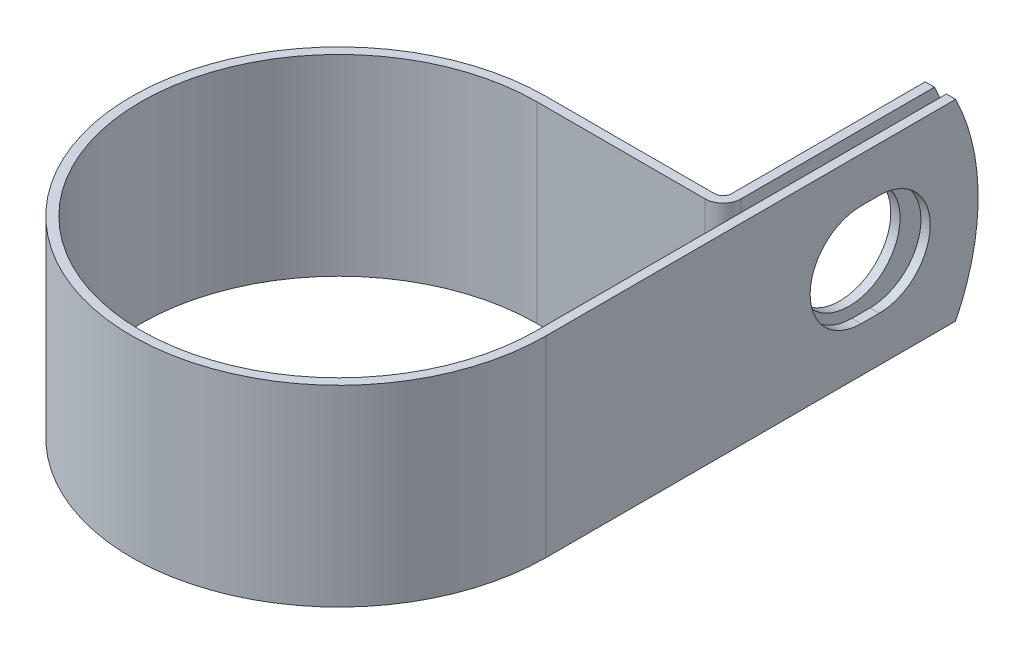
ISO-10303-21;
HEADER;
FILE_DESCRIPTION(('STEP AP214'),'2;1');
FILE_NAME('part.step','',(''),(''),'','','');
FILE_SCHEMA(('AUTOMOTIVE_DESIGN { 1 0 10303 214 1 1 1 1 }'));
ENDSEC;
DATA;
#1=APPLICATION_CONTEXT('core data for automotive mechanical design processes');
#2=APPLICATION_PROTOCOL_DEFINITION('international standard','automotive_design',2000,#1);
#3=PRODUCT_CONTEXT('',#1,'mechanical');
#4=PRODUCT('Part','Part','',(#3));
#5=PRODUCT_RELATED_PRODUCT_CATEGORY('part','',(#4));
#6=PRODUCT_DEFINITION_FORMATION('','',#4);
#7=PRODUCT_DEFINITION_CONTEXT('part definition',#1,'design');
#8=PRODUCT_DEFINITION('design','',#6,#7);
#9=PRODUCT_DEFINITION_SHAPE('','',#8);
#10=(LENGTH_UNIT() NAMED_UNIT(*) SI_UNIT(.MILLI.,.METRE.));
#11=(NAMED_UNIT(*) PLANE_ANGLE_UNIT() SI_UNIT($,.RADIAN.));
#12=(NAMED_UNIT(*) SI_UNIT($,.STERADIAN.) SOLID_ANGLE_UNIT());
#13=UNCERTAINTY_MEASURE_WITH_UNIT(LENGTH_MEASURE(1.E-05),#10,'distance_accuracy_value','');
#14=(GEOMETRIC_REPRESENTATION_CONTEXT(3) GLOBAL_UNCERTAINTY_ASSIGNED_CONTEXT((#13)) GLOBAL_UNIT_ASSIGNED_CONTEXT((#10,
#11,#12)) REPRESENTATION_CONTEXT('',''));
#15=CARTESIAN_POINT('',(0.,0.,0.));
#16=DIRECTION('',(0.,0.,1.));
#17=DIRECTION('',(1.,0.,0.));
#18=AXIS2_PLACEMENT_3D('',#15,#16,#17);
#19=CARTESIAN_POINT('',(26.1874,12.7,0.));
#20=DIRECTION('',(-1.,0.,0.));
#21=DIRECTION('',(0.,0.,1.));
#22=AXIS2_PLACEMENT_3D('',#19,#20,#21);
#23=PLANE('',#22);
#24=DIRECTION('',(0.,0.,-1.));
#25=VECTOR('',#24,1.);
#26=CARTESIAN_POINT('',(26.1874,-6.7437,-41.6559999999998));
#27=LINE('',#26,#25);
#28=CARTESIAN_POINT('',(26.1874,-6.7437,-41.6559999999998));
#29=VERTEX_POINT('',#28);
#30=CARTESIAN_POINT('',(26.1874,-6.7437,-44.0436000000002));
#31=VERTEX_POINT('',#30);
#32=EDGE_CURVE('E236',#29,#31,#27,.T.);
#33=ORIENTED_EDGE('',*,*,#32,.T.);
#34=CARTESIAN_POINT('',(26.1874,0.,-44.0435999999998));
#35=DIRECTION('',(-1.,0.,0.));
#36=DIRECTION('',(0.,0.,1.));
#37=AXIS2_PLACEMENT_3D('',#34,#35,#36);
#38=CIRCLE('',#37,6.7437);
#39=CARTESIAN_POINT('',(26.1874,6.7437,-44.0436000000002));
#40=VERTEX_POINT('',#39);
#41=EDGE_CURVE('E257',#31,#40,#38,.F.);
#42=ORIENTED_EDGE('',*,*,#41,.T.);
#43=DIRECTION('',(0.,0.,1.));
#44=VECTOR('',#43,1.);
#45=CARTESIAN_POINT('',(26.1874,6.7437,-41.6559999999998));
#46=LINE('',#45,#44);
#47=CARTESIAN_POINT('',(26.1874,6.7437,-41.6559999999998));
#48=VERTEX_POINT('',#47);
#49=EDGE_CURVE('E253',#40,#48,#46,.T.);
#50=ORIENTED_EDGE('',*,*,#49,.T.);
#51=CARTESIAN_POINT('',(26.1874,0.,-41.6559999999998));
#52=DIRECTION('',(-1.,0.,0.));
#53=DIRECTION('',(0.,0.,1.));
#54=AXIS2_PLACEMENT_3D('',#51,#52,#53);
#55=CIRCLE('',#54,6.7437);
#56=EDGE_CURVE('E248',#48,#29,#55,.F.);
#57=ORIENTED_EDGE('',*,*,#56,.T.);
#58=EDGE_LOOP('',(#33,#42,#50,#57));
#59=FACE_BOUND('',#58,.T.);
#60=CARTESIAN_POINT('',(26.1874,0.,-28.5496));
#61=DIRECTION('',(-1.,0.,0.));
#62=DIRECTION('',(0.,0.,1.));
#63=AXIS2_PLACEMENT_3D('',#60,#61,#62);
#64=CIRCLE('',#63,28.575);
#65=CARTESIAN_POINT('',(26.1874,12.7,-54.1472683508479));
#66=VERTEX_POINT('',#65);
#67=CARTESIAN_POINT('',(26.1874,-12.7,-54.1472683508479));
#68=VERTEX_POINT('',#67);
#69=EDGE_CURVE('E75',#66,#68,#64,.T.);
#70=ORIENTED_EDGE('',*,*,#69,.T.);
#71=DIRECTION('',(0.,0.,-1.));
#72=VECTOR('',#71,1.);
#73=CARTESIAN_POINT('',(26.1874,-12.7,0.));
#74=LINE('',#73,#72);
#75=CARTESIAN_POINT('',(26.1874,-12.7,0.));
#76=VERTEX_POINT('',#75);
#77=EDGE_CURVE('E271',#76,#68,#74,.T.);
#78=ORIENTED_EDGE('',*,*,#77,.F.);
#79=DIRECTION('',(0.,-1.,0.));
#80=VECTOR('',#79,1.);
#81=CARTESIAN_POINT('',(26.1874,12.7,0.));
#82=LINE('',#81,#80);
#83=CARTESIAN_POINT('',(26.1874,12.7,0.));
#84=VERTEX_POINT('',#83);
#85=EDGE_CURVE('E218',#84,#76,#82,.T.);
#86=ORIENTED_EDGE('',*,*,#85,.F.);
#87=DIRECTION('',(0.,0.,-1.));
#88=VECTOR('',#87,1.);
#89=CARTESIAN_POINT('',(26.1874,12.7,-26.1874));
#90=LINE('',#89,#88);
#91=EDGE_CURVE('E273',#84,#66,#90,.T.);
#92=ORIENTED_EDGE('',*,*,#91,.T.);
#93=EDGE_LOOP('',(#70,#78,#86,#92));
#94=FACE_BOUND('',#93,.T.);
#95=ADVANCED_FACE('F54',(#59,#94),#23,.T.);
#96=CARTESIAN_POINT('',(24.6126,12.7,-57.1246));
#97=DIRECTION('',(1.,0.,0.));
#98=DIRECTION('',(0.,0.,-1.));
#99=AXIS2_PLACEMENT_3D('',#96,#97,#98);
#100=PLANE('',#99);
#101=CARTESIAN_POINT('',(24.6126,0.,-42.8498));
#102=DIRECTION('',(1.,0.,0.));
#103=DIRECTION('',(0.,0.,-1.));
#104=AXIS2_PLACEMENT_3D('',#101,#102,#103);
#105=CIRCLE('',#104,6.7437);
#106=CARTESIAN_POINT('',(24.6126,0.,-49.5935));
#107=VERTEX_POINT('',#106);
#108=EDGE_CURVE('E268',#107,#107,#105,.F.);
#109=ORIENTED_EDGE('',*,*,#108,.T.);
#110=EDGE_LOOP('',(#109));
#111=FACE_BOUND('',#110,.T.);
#112=DIRECTION('',(0.,0.,1.));
#113=VECTOR('',#112,1.);
#114=CARTESIAN_POINT('',(24.6126,-12.7,-57.1246));
#115=LINE('',#114,#113);
#116=CARTESIAN_POINT('',(24.6126,-12.7,-54.1472683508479));
#117=VERTEX_POINT('',#116);
#118=CARTESIAN_POINT('',(24.6126,-12.7,-28.56484));
#119=VERTEX_POINT('',#118);
#120=EDGE_CURVE('E184',#117,#119,#115,.T.);
#121=ORIENTED_EDGE('',*,*,#120,.F.);
#122=CARTESIAN_POINT('',(24.6126,0.,-28.5496));
#123=DIRECTION('',(1.,0.,0.));
#124=DIRECTION('',(0.,0.,-1.));
#125=AXIS2_PLACEMENT_3D('',#122,#123,#124);
#126=CIRCLE('',#125,28.575);
#127=CARTESIAN_POINT('',(24.6126,12.7,-54.1472683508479));
#128=VERTEX_POINT('',#127);
#129=EDGE_CURVE('E176',#117,#128,#126,.T.);
#130=ORIENTED_EDGE('',*,*,#129,.T.);
#131=DIRECTION('',(0.,0.,1.));
#132=VECTOR('',#131,1.);
#133=CARTESIAN_POINT('',(24.6126,12.7,-57.1246));
#134=LINE('',#133,#132);
#135=CARTESIAN_POINT('',(24.6126,12.7,-28.56484));
#136=VERTEX_POINT('',#135);
#137=EDGE_CURVE('E224',#128,#136,#134,.T.);
#138=ORIENTED_EDGE('',*,*,#137,.T.);
#139=DIRECTION('',(0.,-1.,0.));
#140=VECTOR('',#139,1.);
#141=CARTESIAN_POINT('',(24.6126,12.7,-28.56484));
#142=LINE('',#141,#140);
#143=EDGE_CURVE('E211',#136,#119,#142,.T.);
#144=ORIENTED_EDGE('',*,*,#143,.T.);
#145=EDGE_LOOP('',(#121,#130,#138,#144));
#146=FACE_BOUND('',#145,.T.);
#147=ADVANCED_FACE('F226',(#111,#146),#100,.T.);
#148=CARTESIAN_POINT('',(23.3934,12.7,-57.1246));
#149=DIRECTION('',(1.,0.,0.));
#150=DIRECTION('',(0.,0.,-1.));
#151=AXIS2_PLACEMENT_3D('',#148,#149,#150);
#152=PLANE('',#151);
#153=CARTESIAN_POINT('',(23.3934,0.,-42.8498));
#154=DIRECTION('',(-1.,0.,0.));
#155=DIRECTION('',(0.,0.,1.));
#156=AXIS2_PLACEMENT_3D('',#153,#154,#155);
#157=CIRCLE('',#156,6.7437);
#158=CARTESIAN_POINT('',(23.3934,0.,-36.1061));
#159=VERTEX_POINT('',#158);
#160=EDGE_CURVE('E265',#159,#159,#157,.T.);
#161=ORIENTED_EDGE('',*,*,#160,.F.);
#162=EDGE_LOOP('',(#161));
#163=FACE_BOUND('',#162,.T.);
#164=CARTESIAN_POINT('',(23.3934,0.,-28.5496));
#165=DIRECTION('',(-1.,0.,0.));
#166=DIRECTION('',(0.,0.,1.));
#167=AXIS2_PLACEMENT_3D('',#164,#165,#166);
#168=CIRCLE('',#167,28.575);
#169=CARTESIAN_POINT('',(23.3934,12.7,-54.1472683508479));
#170=VERTEX_POINT('',#169);
#171=CARTESIAN_POINT('',(23.3934,-12.7,-54.1472683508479));
#172=VERTEX_POINT('',#171);
#173=EDGE_CURVE('E67',#170,#172,#168,.T.);
#174=ORIENTED_EDGE('',*,*,#173,.T.);
#175=DIRECTION('',(0.,0.,1.));
#176=VECTOR('',#175,1.);
#177=CARTESIAN_POINT('',(23.3934,-12.7,-57.1246));
#178=LINE('',#177,#176);
#179=CARTESIAN_POINT('',(23.3934,-12.7,-28.56484));
#180=VERTEX_POINT('',#179);
#181=EDGE_CURVE('E167',#172,#180,#178,.T.);
#182=ORIENTED_EDGE('',*,*,#181,.T.);
#183=DIRECTION('',(0.,-1.,0.));
#184=VECTOR('',#183,1.);
#185=CARTESIAN_POINT('',(23.3934,12.7,-28.56484));
#186=LINE('',#185,#184);
#187=CARTESIAN_POINT('',(23.3934,12.7,-28.56484));
#188=VERTEX_POINT('',#187);
#189=EDGE_CURVE('E209',#188,#180,#186,.T.);
#190=ORIENTED_EDGE('',*,*,#189,.F.);
#191=DIRECTION('',(0.,0.,1.));
#192=VECTOR('',#191,1.);
#193=CARTESIAN_POINT('',(23.3934,12.7,-57.1246));
#194=LINE('',#193,#192);
#195=EDGE_CURVE('E169',#170,#188,#194,.T.);
#196=ORIENTED_EDGE('',*,*,#195,.F.);
#197=EDGE_LOOP('',(#174,#182,#190,#196));
#198=FACE_BOUND('',#197,.T.);
#199=ADVANCED_FACE('F164',(#163,#198),#152,.F.);
#200=CARTESIAN_POINT('',(27.4066,12.7,0.));
#201=DIRECTION('',(-1.,0.,0.));
#202=DIRECTION('',(0.,0.,1.));
#203=AXIS2_PLACEMENT_3D('',#200,#201,#202);
#204=PLANE('',#203);
#205=CARTESIAN_POINT('',(27.4066,0.,-44.0435999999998));
#206=DIRECTION('',(1.,0.,0.));
#207=DIRECTION('',(0.,0.,-1.));
#208=AXIS2_PLACEMENT_3D('',#205,#206,#207);
#209=CIRCLE('',#208,6.7437);
#210=CARTESIAN_POINT('',(27.4066,-6.7437,-44.0436000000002));
#211=VERTEX_POINT('',#210);
#212=CARTESIAN_POINT('',(27.4066,6.7437,-44.0436000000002));
#213=VERTEX_POINT('',#212);
#214=EDGE_CURVE('E237',#211,#213,#209,.T.);
#215=ORIENTED_EDGE('',*,*,#214,.F.);
#216=DIRECTION('',(0.,0.,-1.));
#217=VECTOR('',#216,1.);
#218=CARTESIAN_POINT('',(27.4066,-6.7437,-41.6559999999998));
#219=LINE('',#218,#217);
#220=CARTESIAN_POINT('',(27.4066,-6.7437,-41.6559999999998));
#221=VERTEX_POINT('',#220);
#222=EDGE_CURVE('E240',#221,#211,#219,.T.);
#223=ORIENTED_EDGE('',*,*,#222,.F.);
#224=CARTESIAN_POINT('',(27.4066,0.,-41.6559999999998));
#225=DIRECTION('',(1.,0.,0.));
#226=DIRECTION('',(0.,0.,-1.));
#227=AXIS2_PLACEMENT_3D('',#224,#225,#226);
#228=CIRCLE('',#227,6.7437);
#229=CARTESIAN_POINT('',(27.4066,6.7437,-41.6559999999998));
#230=VERTEX_POINT('',#229);
#231=EDGE_CURVE('E230',#230,#221,#228,.T.);
#232=ORIENTED_EDGE('',*,*,#231,.F.);
#233=DIRECTION('',(0.,0.,1.));
#234=VECTOR('',#233,1.);
#235=CARTESIAN_POINT('',(27.4066,6.7437,-41.6559999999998));
#236=LINE('',#235,#234);
#237=EDGE_CURVE('E234',#213,#230,#236,.T.);
#238=ORIENTED_EDGE('',*,*,#237,.F.);
#239=EDGE_LOOP('',(#215,#223,#232,#238));
#240=FACE_BOUND('',#239,.T.);
#241=DIRECTION('',(0.,0.,-1.));
#242=VECTOR('',#241,1.);
#243=CARTESIAN_POINT('',(27.4066,-12.7,0.));
#244=LINE('',#243,#242);
#245=CARTESIAN_POINT('',(27.4066,-12.7,0.));
#246=VERTEX_POINT('',#245);
#247=CARTESIAN_POINT('',(27.4066,-12.7,-54.1472683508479));
#248=VERTEX_POINT('',#247);
#249=EDGE_CURVE('E195',#246,#248,#244,.T.);
#250=ORIENTED_EDGE('',*,*,#249,.T.);
#251=CARTESIAN_POINT('',(27.4066,0.,-28.5496));
#252=DIRECTION('',(-1.,0.,0.));
#253=DIRECTION('',(0.,0.,1.));
#254=AXIS2_PLACEMENT_3D('',#251,#252,#253);
#255=CIRCLE('',#254,28.575);
#256=CARTESIAN_POINT('',(27.4066,12.7,-54.1472683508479));
#257=VERTEX_POINT('',#256);
#258=EDGE_CURVE('E170',#257,#248,#255,.T.);
#259=ORIENTED_EDGE('',*,*,#258,.F.);
#260=DIRECTION('',(0.,0.,-1.));
#261=VECTOR('',#260,1.);
#262=CARTESIAN_POINT('',(27.4066,12.7,-26.1874));
#263=LINE('',#262,#261);
#264=CARTESIAN_POINT('',(27.4066,12.7,0.));
#265=VERTEX_POINT('',#264);
#266=EDGE_CURVE('E198',#265,#257,#263,.T.);
#267=ORIENTED_EDGE('',*,*,#266,.F.);
#268=DIRECTION('',(0.,-1.,0.));
#269=VECTOR('',#268,1.);
#270=CARTESIAN_POINT('',(27.4066,12.7,0.));
#271=LINE('',#270,#269);
#272=EDGE_CURVE('E199',#265,#246,#271,.T.);
#273=ORIENTED_EDGE('',*,*,#272,.T.);
#274=EDGE_LOOP('',(#250,#259,#267,#273));
#275=FACE_BOUND('',#274,.T.);
#276=ADVANCED_FACE('F321',(#240,#275),#204,.F.);
#277=CARTESIAN_POINT('',(0.,-12.7,0.));
#278=DIRECTION('',(0.,1.,0.));
#279=DIRECTION('',(1.,0.,0.));
#280=AXIS2_PLACEMENT_3D('',#277,#278,#279);
#281=PLANE('',#280);
#282=DIRECTION('',(-1.,0.,0.));
#283=VECTOR('',#282,1.);
#284=CARTESIAN_POINT('',(27.4066,-12.7,-54.1472683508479));
#285=LINE('',#284,#283);
#286=EDGE_CURVE('E171',#248,#68,#285,.T.);
#287=ORIENTED_EDGE('',*,*,#286,.F.);
#288=ORIENTED_EDGE('',*,*,#249,.F.);
#289=CARTESIAN_POINT('',(0.,-12.7,0.));
#290=DIRECTION('',(0.,1.,0.));
#291=DIRECTION('',(1.,0.,0.));
#292=AXIS2_PLACEMENT_3D('',#289,#290,#291);
#293=CIRCLE('',#292,27.4066);
#294=CARTESIAN_POINT('',(0.,-12.7,-27.4066));
#295=VERTEX_POINT('',#294);
#296=EDGE_CURVE('E193',#295,#246,#293,.T.);
#297=ORIENTED_EDGE('',*,*,#296,.F.);
#298=DIRECTION('',(1.,0.,0.));
#299=VECTOR('',#298,1.);
#300=CARTESIAN_POINT('',(0.,-12.7,-27.4066));
#301=LINE('',#300,#299);
#302=CARTESIAN_POINT('',(22.23516,-12.7,-27.4066));
#303=VERTEX_POINT('',#302);
#304=EDGE_CURVE('E186',#303,#295,#301,.F.);
#305=ORIENTED_EDGE('',*,*,#304,.F.);
#306=CARTESIAN_POINT('',(22.23516,-12.7,-28.56484));
#307=DIRECTION('',(0.,1.,0.));
#308=DIRECTION('',(1.,0.,0.));
#309=AXIS2_PLACEMENT_3D('',#306,#307,#308);
#310=CIRCLE('',#309,1.15824);
#311=EDGE_CURVE('E183',#180,#303,#310,.F.);
#312=ORIENTED_EDGE('',*,*,#311,.F.);
#313=ORIENTED_EDGE('',*,*,#181,.F.);
#314=DIRECTION('',(-1.,0.,0.));
#315=VECTOR('',#314,1.);
#316=CARTESIAN_POINT('',(27.4066,-12.7,-54.1472683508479));
#317=LINE('',#316,#315);
#318=EDGE_CURVE('E12',#117,#172,#317,.T.);
#319=ORIENTED_EDGE('',*,*,#318,.F.);
#320=ORIENTED_EDGE('',*,*,#120,.T.);
#321=CARTESIAN_POINT('',(22.23516,-12.7,-28.56484));
#322=DIRECTION('',(0.,-1.,0.));
#323=DIRECTION('',(0.,0.,1.));
#324=AXIS2_PLACEMENT_3D('',#321,#322,#323);
#325=CIRCLE('',#324,2.37744);
#326=CARTESIAN_POINT('',(22.23516,-12.7,-26.1874));
#327=VERTEX_POINT('',#326);
#328=EDGE_CURVE('E188',#119,#327,#325,.T.);
#329=ORIENTED_EDGE('',*,*,#328,.T.);
#330=DIRECTION('',(-1.,0.,0.));
#331=VECTOR('',#330,1.);
#332=CARTESIAN_POINT('',(0.,-12.7,-26.1874));
#333=LINE('',#332,#331);
#334=CARTESIAN_POINT('',(0.,-12.7,-26.1874));
#335=VERTEX_POINT('',#334);
#336=EDGE_CURVE('E298',#327,#335,#333,.T.);
#337=ORIENTED_EDGE('',*,*,#336,.T.);
#338=CARTESIAN_POINT('',(0.,-12.7,0.));
#339=DIRECTION('',(0.,1.,0.));
#340=DIRECTION('',(0.,0.,1.));
#341=AXIS2_PLACEMENT_3D('',#338,#339,#340);
#342=CIRCLE('',#341,26.1874);
#343=EDGE_CURVE('E295',#335,#76,#342,.T.);
#344=ORIENTED_EDGE('',*,*,#343,.T.);
#345=ORIENTED_EDGE('',*,*,#77,.T.);
#346=EDGE_LOOP('',(#287,#288,#297,#305,#312,#313,#319,#320,#329,#337,#344,#345));
#347=FACE_BOUND('',#346,.T.);
#348=ADVANCED_FACE('F181',(#347),#281,.F.);
#349=CARTESIAN_POINT('',(0.,12.7,0.));
#350=DIRECTION('',(0.,1.,0.));
#351=DIRECTION('',(1.,0.,0.));
#352=AXIS2_PLACEMENT_3D('',#349,#350,#351);
#353=PLANE('',#352);
#354=ORIENTED_EDGE('',*,*,#266,.T.);
#355=DIRECTION('',(-1.,0.,0.));
#356=VECTOR('',#355,1.);
#357=CARTESIAN_POINT('',(27.4066,12.7,-54.1472683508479));
#358=LINE('',#357,#356);
#359=EDGE_CURVE('E228',#257,#66,#358,.T.);
#360=ORIENTED_EDGE('',*,*,#359,.T.);
#361=ORIENTED_EDGE('',*,*,#91,.F.);
#362=CARTESIAN_POINT('',(0.,12.7,0.));
#363=DIRECTION('',(0.,1.,0.));
#364=DIRECTION('',(0.,0.,1.));
#365=AXIS2_PLACEMENT_3D('',#362,#363,#364);
#366=CIRCLE('',#365,26.1874);
#367=CARTESIAN_POINT('',(0.,12.7,-26.1874));
#368=VERTEX_POINT('',#367);
#369=EDGE_CURVE('E276',#368,#84,#366,.T.);
#370=ORIENTED_EDGE('',*,*,#369,.F.);
#371=DIRECTION('',(-1.,0.,0.));
#372=VECTOR('',#371,1.);
#373=CARTESIAN_POINT('',(0.,12.7,-26.1874));
#374=LINE('',#373,#372);
#375=CARTESIAN_POINT('',(22.23516,12.7,-26.1874));
#376=VERTEX_POINT('',#375);
#377=EDGE_CURVE('E279',#376,#368,#374,.T.);
#378=ORIENTED_EDGE('',*,*,#377,.F.);
#379=CARTESIAN_POINT('',(22.23516,12.7,-28.56484));
#380=DIRECTION('',(0.,-1.,0.));
#381=DIRECTION('',(0.,0.,1.));
#382=AXIS2_PLACEMENT_3D('',#379,#380,#381);
#383=CIRCLE('',#382,2.37744);
#384=EDGE_CURVE('E282',#136,#376,#383,.T.);
#385=ORIENTED_EDGE('',*,*,#384,.F.);
#386=ORIENTED_EDGE('',*,*,#137,.F.);
#387=DIRECTION('',(-1.,0.,0.));
#388=VECTOR('',#387,1.);
#389=CARTESIAN_POINT('',(27.4066,12.7,-54.1472683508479));
#390=LINE('',#389,#388);
#391=EDGE_CURVE('E61',#128,#170,#390,.T.);
#392=ORIENTED_EDGE('',*,*,#391,.T.);
#393=ORIENTED_EDGE('',*,*,#195,.T.);
#394=CARTESIAN_POINT('',(22.23516,12.7,-28.56484));
#395=DIRECTION('',(0.,1.,0.));
#396=DIRECTION('',(1.,0.,0.));
#397=AXIS2_PLACEMENT_3D('',#394,#395,#396);
#398=CIRCLE('',#397,1.15824);
#399=CARTESIAN_POINT('',(22.23516,12.7,-27.4066));
#400=VERTEX_POINT('',#399);
#401=EDGE_CURVE('E287',#188,#400,#398,.F.);
#402=ORIENTED_EDGE('',*,*,#401,.T.);
#403=DIRECTION('',(1.,0.,0.));
#404=VECTOR('',#403,1.);
#405=CARTESIAN_POINT('',(0.,12.7,-27.4066));
#406=LINE('',#405,#404);
#407=CARTESIAN_POINT('',(0.,12.7,-27.4066));
#408=VERTEX_POINT('',#407);
#409=EDGE_CURVE('E289',#400,#408,#406,.F.);
#410=ORIENTED_EDGE('',*,*,#409,.T.);
#411=CARTESIAN_POINT('',(0.,12.7,0.));
#412=DIRECTION('',(0.,1.,0.));
#413=DIRECTION('',(1.,0.,0.));
#414=AXIS2_PLACEMENT_3D('',#411,#412,#413);
#415=CIRCLE('',#414,27.4066);
#416=EDGE_CURVE('E203',#408,#265,#415,.T.);
#417=ORIENTED_EDGE('',*,*,#416,.T.);
#418=EDGE_LOOP('',(#354,#360,#361,#370,#378,#385,#386,#392,#393,#402,#410,#417));
#419=FACE_BOUND('',#418,.T.);
#420=ADVANCED_FACE('F222',(#419),#353,.T.);
#421=CARTESIAN_POINT('',(0.,12.7,0.));
#422=DIRECTION('',(0.,-1.,0.));
#423=DIRECTION('',(0.,0.,-1.));
#424=AXIS2_PLACEMENT_3D('',#421,#422,#423);
#425=CYLINDRICAL_SURFACE('',#424,26.1874);
#426=ORIENTED_EDGE('',*,*,#343,.F.);
#427=DIRECTION('',(0.,-1.,0.));
#428=VECTOR('',#427,1.);
#429=CARTESIAN_POINT('',(0.,12.7,-26.1874));
#430=LINE('',#429,#428);
#431=EDGE_CURVE('E216',#368,#335,#430,.T.);
#432=ORIENTED_EDGE('',*,*,#431,.F.);
#433=ORIENTED_EDGE('',*,*,#369,.T.);
#434=ORIENTED_EDGE('',*,*,#85,.T.);
#435=EDGE_LOOP('',(#426,#432,#433,#434));
#436=FACE_BOUND('',#435,.T.);
#437=ADVANCED_FACE('F311',(#436),#425,.F.);
#438=CARTESIAN_POINT('',(0.,12.7,-26.1874));
#439=DIRECTION('',(0.,0.,1.));
#440=DIRECTION('',(1.,0.,0.));
#441=AXIS2_PLACEMENT_3D('',#438,#439,#440);
#442=PLANE('',#441);
#443=ORIENTED_EDGE('',*,*,#336,.F.);
#444=DIRECTION('',(0.,-1.,0.));
#445=VECTOR('',#444,1.);
#446=CARTESIAN_POINT('',(22.23516,12.7,-26.1874));
#447=LINE('',#446,#445);
#448=EDGE_CURVE('E214',#376,#327,#447,.T.);
#449=ORIENTED_EDGE('',*,*,#448,.F.);
#450=ORIENTED_EDGE('',*,*,#377,.T.);
#451=ORIENTED_EDGE('',*,*,#431,.T.);
#452=EDGE_LOOP('',(#443,#449,#450,#451));
#453=FACE_BOUND('',#452,.T.);
#454=ADVANCED_FACE('F307',(#453),#442,.T.);
#455=CARTESIAN_POINT('',(22.23516,12.7,-28.56484));
#456=DIRECTION('',(0.,-1.,0.));
#457=DIRECTION('',(0.,0.,-1.));
#458=AXIS2_PLACEMENT_3D('',#455,#456,#457);
#459=CYLINDRICAL_SURFACE('',#458,2.37744);
#460=ORIENTED_EDGE('',*,*,#328,.F.);
#461=ORIENTED_EDGE('',*,*,#143,.F.);
#462=ORIENTED_EDGE('',*,*,#384,.T.);
#463=ORIENTED_EDGE('',*,*,#448,.T.);
#464=EDGE_LOOP('',(#460,#461,#462,#463));
#465=FACE_BOUND('',#464,.T.);
#466=ADVANCED_FACE('F304',(#465),#459,.T.);
#467=CARTESIAN_POINT('',(22.23516,12.7,-28.56484));
#468=DIRECTION('',(0.,-1.,0.));
#469=DIRECTION('',(0.,0.,-1.));
#470=AXIS2_PLACEMENT_3D('',#467,#468,#469);
#471=CYLINDRICAL_SURFACE('',#470,1.15824);
#472=ORIENTED_EDGE('',*,*,#311,.T.);
#473=DIRECTION('',(0.,-1.,0.));
#474=VECTOR('',#473,1.);
#475=CARTESIAN_POINT('',(22.23516,12.7,-27.4066));
#476=LINE('',#475,#474);
#477=EDGE_CURVE('E206',#400,#303,#476,.T.);
#478=ORIENTED_EDGE('',*,*,#477,.F.);
#479=ORIENTED_EDGE('',*,*,#401,.F.);
#480=ORIENTED_EDGE('',*,*,#189,.T.);
#481=EDGE_LOOP('',(#472,#478,#479,#480));
#482=FACE_BOUND('',#481,.T.);
#483=ADVANCED_FACE('F334',(#482),#471,.F.);
#484=CARTESIAN_POINT('',(0.,12.7,-27.4066));
#485=DIRECTION('',(0.,0.,1.));
#486=DIRECTION('',(1.,0.,0.));
#487=AXIS2_PLACEMENT_3D('',#484,#485,#486);
#488=PLANE('',#487);
#489=ORIENTED_EDGE('',*,*,#304,.T.);
#490=DIRECTION('',(0.,-1.,0.));
#491=VECTOR('',#490,1.);
#492=CARTESIAN_POINT('',(0.,12.7,-27.4066));
#493=LINE('',#492,#491);
#494=EDGE_CURVE('E202',#408,#295,#493,.T.);
#495=ORIENTED_EDGE('',*,*,#494,.F.);
#496=ORIENTED_EDGE('',*,*,#409,.F.);
#497=ORIENTED_EDGE('',*,*,#477,.T.);
#498=EDGE_LOOP('',(#489,#495,#496,#497));
#499=FACE_BOUND('',#498,.T.);
#500=ADVANCED_FACE('F330',(#499),#488,.F.);
#501=CARTESIAN_POINT('',(0.,12.7,0.));
#502=DIRECTION('',(0.,-1.,0.));
#503=DIRECTION('',(0.,0.,-1.));
#504=AXIS2_PLACEMENT_3D('',#501,#502,#503);
#505=CYLINDRICAL_SURFACE('',#504,27.4066);
#506=ORIENTED_EDGE('',*,*,#296,.T.);
#507=ORIENTED_EDGE('',*,*,#272,.F.);
#508=ORIENTED_EDGE('',*,*,#416,.F.);
#509=ORIENTED_EDGE('',*,*,#494,.T.);
#510=EDGE_LOOP('',(#506,#507,#508,#509));
#511=FACE_BOUND('',#510,.T.);
#512=ADVANCED_FACE('F327',(#511),#505,.T.);
#513=CARTESIAN_POINT('',(43.6866640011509,0.,-42.8498));
#514=DIRECTION('',(-1.,0.,0.));
#515=DIRECTION('',(0.,0.,1.));
#516=AXIS2_PLACEMENT_3D('',#513,#514,#515);
#517=CYLINDRICAL_SURFACE('',#516,6.7437);
#518=ORIENTED_EDGE('',*,*,#160,.T.);
#519=EDGE_LOOP('',(#518));
#520=FACE_BOUND('',#519,.T.);
#521=ORIENTED_EDGE('',*,*,#108,.F.);
#522=EDGE_LOOP('',(#521));
#523=FACE_BOUND('',#522,.T.);
#524=ADVANCED_FACE('F379',(#520,#523),#517,.F.);
#525=CARTESIAN_POINT('',(5.35651946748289,-6.7437,-41.6559999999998));
#526=DIRECTION('',(0.,-1.,0.));
#527=DIRECTION('',(0.,0.,-1.));
#528=AXIS2_PLACEMENT_3D('',#525,#526,#527);
#529=PLANE('',#528);
#530=DIRECTION('',(1.,0.,0.));
#531=VECTOR('',#530,1.);
#532=CARTESIAN_POINT('',(5.35651946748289,-6.7437,-41.6559999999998));
#533=LINE('',#532,#531);
#534=EDGE_CURVE('E251',#29,#221,#533,.T.);
#535=ORIENTED_EDGE('',*,*,#534,.T.);
#536=ORIENTED_EDGE('',*,*,#222,.T.);
#537=DIRECTION('',(1.,0.,0.));
#538=VECTOR('',#537,1.);
#539=CARTESIAN_POINT('',(5.35651946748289,-6.7437,-44.0436000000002));
#540=LINE('',#539,#538);
#541=EDGE_CURVE('E247',#31,#211,#540,.T.);
#542=ORIENTED_EDGE('',*,*,#541,.F.);
#543=ORIENTED_EDGE('',*,*,#32,.F.);
#544=EDGE_LOOP('',(#535,#536,#542,#543));
#545=FACE_BOUND('',#544,.T.);
#546=ADVANCED_FACE('F354',(#545),#529,.F.);
#547=CARTESIAN_POINT('',(5.35651946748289,0.,-44.0435999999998));
#548=DIRECTION('',(1.,0.,0.));
#549=DIRECTION('',(0.,0.,-1.));
#550=AXIS2_PLACEMENT_3D('',#547,#548,#549);
#551=CYLINDRICAL_SURFACE('',#550,6.7437);
#552=ORIENTED_EDGE('',*,*,#541,.T.);
#553=ORIENTED_EDGE('',*,*,#214,.T.);
#554=DIRECTION('',(1.,0.,0.));
#555=VECTOR('',#554,1.);
#556=CARTESIAN_POINT('',(5.35651946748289,6.7437,-44.0436000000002));
#557=LINE('',#556,#555);
#558=EDGE_CURVE('E256',#40,#213,#557,.T.);
#559=ORIENTED_EDGE('',*,*,#558,.F.);
#560=ORIENTED_EDGE('',*,*,#41,.F.);
#561=EDGE_LOOP('',(#552,#553,#559,#560));
#562=FACE_BOUND('',#561,.T.);
#563=ADVANCED_FACE('F358',(#562),#551,.F.);
#564=CARTESIAN_POINT('',(5.35651946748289,6.7437,-41.6559999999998));
#565=DIRECTION('',(0.,1.,0.));
#566=DIRECTION('',(0.,0.,1.));
#567=AXIS2_PLACEMENT_3D('',#564,#565,#566);
#568=PLANE('',#567);
#569=ORIENTED_EDGE('',*,*,#558,.T.);
#570=ORIENTED_EDGE('',*,*,#237,.T.);
#571=DIRECTION('',(1.,0.,0.));
#572=VECTOR('',#571,1.);
#573=CARTESIAN_POINT('',(5.35651946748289,6.7437,-41.6559999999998));
#574=LINE('',#573,#572);
#575=EDGE_CURVE('E252',#48,#230,#574,.T.);
#576=ORIENTED_EDGE('',*,*,#575,.F.);
#577=ORIENTED_EDGE('',*,*,#49,.F.);
#578=EDGE_LOOP('',(#569,#570,#576,#577));
#579=FACE_BOUND('',#578,.T.);
#580=ADVANCED_FACE('F362',(#579),#568,.F.);
#581=CARTESIAN_POINT('',(5.35651946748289,0.,-41.6559999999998));
#582=DIRECTION('',(1.,0.,0.));
#583=DIRECTION('',(0.,0.,-1.));
#584=AXIS2_PLACEMENT_3D('',#581,#582,#583);
#585=CYLINDRICAL_SURFACE('',#584,6.7437);
#586=ORIENTED_EDGE('',*,*,#575,.T.);
#587=ORIENTED_EDGE('',*,*,#231,.T.);
#588=ORIENTED_EDGE('',*,*,#534,.F.);
#589=ORIENTED_EDGE('',*,*,#56,.F.);
#590=EDGE_LOOP('',(#586,#587,#588,#589));
#591=FACE_BOUND('',#590,.T.);
#592=ADVANCED_FACE('F366',(#591),#585,.F.);
#593=CARTESIAN_POINT('',(27.4066,0.,-28.5496));
#594=DIRECTION('',(-1.,0.,0.));
#595=DIRECTION('',(0.,0.,1.));
#596=AXIS2_PLACEMENT_3D('',#593,#594,#595);
#597=CYLINDRICAL_SURFACE('',#596,28.575);
#598=ORIENTED_EDGE('',*,*,#129,.F.);
#599=ORIENTED_EDGE('',*,*,#318,.T.);
#600=ORIENTED_EDGE('',*,*,#173,.F.);
#601=ORIENTED_EDGE('',*,*,#391,.F.);
#602=EDGE_LOOP('',(#598,#599,#600,#601));
#603=FACE_BOUND('',#602,.T.);
#604=ADVANCED_FACE('F174',(#603),#597,.T.);
#605=ORIENTED_EDGE('',*,*,#359,.F.);
#606=ORIENTED_EDGE('',*,*,#258,.T.);
#607=ORIENTED_EDGE('',*,*,#286,.T.);
#608=ORIENTED_EDGE('',*,*,#69,.F.);
#609=EDGE_LOOP('',(#605,#606,#607,#608));
#610=FACE_BOUND('',#609,.T.);
#611=ADVANCED_FACE('F316',(#610),#597,.T.);
#612=CLOSED_SHELL('',(#95,#147,#199,#276,#348,#420,#437,#454,#466,#483,#500,#512,#524,#546,#563,
#580,#592,#604,#611));
#613=MANIFOLD_SOLID_BREP('B2',#612);
#614=ADVANCED_BREP_SHAPE_REPRESENTATION('',(#18,#613),#14);
#615=SHAPE_DEFINITION_REPRESENTATION(#9,#614);
ENDSEC;
END-ISO-10303-21;
